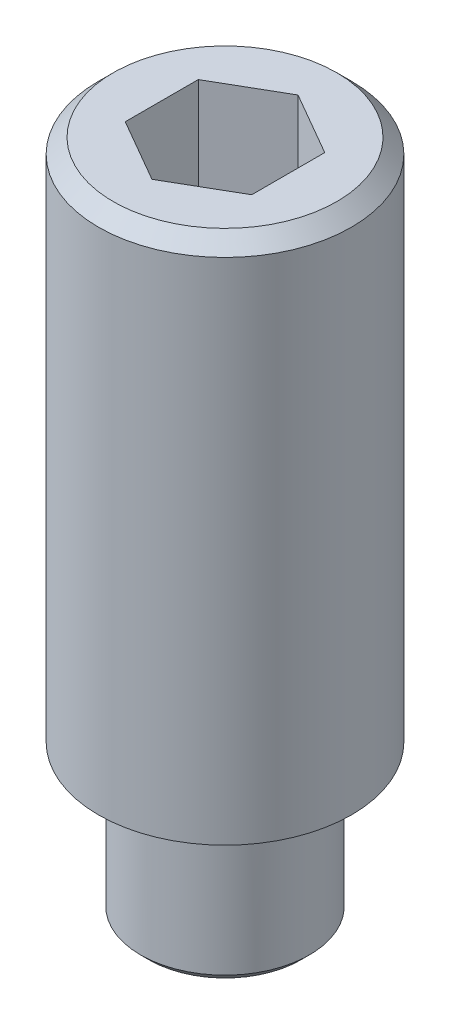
ISO-10303-21;
HEADER;
FILE_DESCRIPTION(('STEP AP214'),'2;1');
FILE_NAME('part.step','',(''),(''),'','','');
FILE_SCHEMA(('AUTOMOTIVE_DESIGN { 1 0 10303 214 1 1 1 1 }'));
ENDSEC;
DATA;
#1=APPLICATION_CONTEXT('core data for automotive mechanical design processes');
#2=APPLICATION_PROTOCOL_DEFINITION('international standard','automotive_design',2000,#1);
#3=PRODUCT_CONTEXT('',#1,'mechanical');
#4=PRODUCT('Part','Part','',(#3));
#5=PRODUCT_RELATED_PRODUCT_CATEGORY('part','',(#4));
#6=PRODUCT_DEFINITION_FORMATION('','',#4);
#7=PRODUCT_DEFINITION_CONTEXT('part definition',#1,'design');
#8=PRODUCT_DEFINITION('design','',#6,#7);
#9=PRODUCT_DEFINITION_SHAPE('','',#8);
#10=(LENGTH_UNIT() NAMED_UNIT(*) SI_UNIT(.MILLI.,.METRE.));
#11=(NAMED_UNIT(*) PLANE_ANGLE_UNIT() SI_UNIT($,.RADIAN.));
#12=(NAMED_UNIT(*) SI_UNIT($,.STERADIAN.) SOLID_ANGLE_UNIT());
#13=UNCERTAINTY_MEASURE_WITH_UNIT(LENGTH_MEASURE(1.E-05),#10,'distance_accuracy_value','');
#14=(GEOMETRIC_REPRESENTATION_CONTEXT(3) GLOBAL_UNCERTAINTY_ASSIGNED_CONTEXT((#13)) GLOBAL_UNIT_ASSIGNED_CONTEXT((#10,
#11,#12)) REPRESENTATION_CONTEXT('',''));
#15=CARTESIAN_POINT('',(0.,0.,0.));
#16=DIRECTION('',(0.,0.,1.));
#17=DIRECTION('',(1.,0.,0.));
#18=AXIS2_PLACEMENT_3D('',#15,#16,#17);
#19=CARTESIAN_POINT('',(0.,0.,0.));
#20=DIRECTION('',(0.,1.,0.));
#21=DIRECTION('',(0.,0.,1.));
#22=AXIS2_PLACEMENT_3D('',#19,#20,#21);
#23=PLANE('',#22);
#24=CARTESIAN_POINT('',(0.,0.,0.));
#25=DIRECTION('',(0.,1.,0.));
#26=DIRECTION('',(0.,0.,1.));
#27=AXIS2_PLACEMENT_3D('',#24,#25,#26);
#28=CIRCLE('',#27,1.8);
#29=CARTESIAN_POINT('',(0.,0.,1.8));
#30=VERTEX_POINT('',#29);
#31=EDGE_CURVE('E151',#30,#30,#28,.F.);
#32=ORIENTED_EDGE('',*,*,#31,.T.);
#33=EDGE_LOOP('',(#32));
#34=FACE_BOUND('',#33,.T.);
#35=ADVANCED_FACE('F38',(#34),#23,.F.);
#36=CARTESIAN_POINT('',(0.,0.,0.));
#37=DIRECTION('',(0.,-1.,0.));
#38=DIRECTION('',(0.,0.,-1.));
#39=AXIS2_PLACEMENT_3D('',#36,#37,#38);
#40=CYLINDRICAL_SURFACE('',#39,2.);
#41=CARTESIAN_POINT('',(0.,0.199999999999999,0.));
#42=DIRECTION('',(0.,1.,0.));
#43=DIRECTION('',(0.,0.,1.));
#44=AXIS2_PLACEMENT_3D('',#41,#42,#43);
#45=CIRCLE('',#44,2.);
#46=CARTESIAN_POINT('',(0.,0.2,2.));
#47=VERTEX_POINT('',#46);
#48=EDGE_CURVE('E154',#47,#47,#45,.T.);
#49=ORIENTED_EDGE('',*,*,#48,.T.);
#50=EDGE_LOOP('',(#49));
#51=FACE_BOUND('',#50,.T.);
#52=CARTESIAN_POINT('',(0.,3.,0.));
#53=DIRECTION('',(0.,-1.,0.));
#54=DIRECTION('',(0.,0.,-1.));
#55=AXIS2_PLACEMENT_3D('',#52,#53,#54);
#56=CIRCLE('',#55,2.);
#57=CARTESIAN_POINT('',(0.,3.,-2.));
#58=VERTEX_POINT('',#57);
#59=EDGE_CURVE('E148',#58,#58,#56,.T.);
#60=ORIENTED_EDGE('',*,*,#59,.T.);
#61=EDGE_LOOP('',(#60));
#62=FACE_BOUND('',#61,.T.);
#63=ADVANCED_FACE('F171',(#51,#62),#40,.T.);
#64=CARTESIAN_POINT('',(0.,3.57735026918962,0.));
#65=DIRECTION('',(0.,1.,0.));
#66=DIRECTION('',(0.,0.,1.));
#67=AXIS2_PLACEMENT_3D('',#64,#65,#66);
#68=CONICAL_SURFACE('',#67,3.,1.0471975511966);
#69=ORIENTED_EDGE('',*,*,#59,.F.);
#70=EDGE_LOOP('',(#69));
#71=FACE_BOUND('',#70,.T.);
#72=CARTESIAN_POINT('',(0.,3.57735026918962,0.));
#73=DIRECTION('',(0.,-1.,0.));
#74=DIRECTION('',(0.,0.,-1.));
#75=AXIS2_PLACEMENT_3D('',#72,#73,#74);
#76=CIRCLE('',#75,3.);
#77=CARTESIAN_POINT('',(0.,3.57735026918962,-3.));
#78=VERTEX_POINT('',#77);
#79=EDGE_CURVE('E140',#78,#78,#76,.T.);
#80=ORIENTED_EDGE('',*,*,#79,.T.);
#81=EDGE_LOOP('',(#80));
#82=FACE_BOUND('',#81,.T.);
#83=ADVANCED_FACE('F177',(#71,#82),#68,.T.);
#84=CARTESIAN_POINT('',(0.,0.,0.));
#85=DIRECTION('',(0.,-1.,0.));
#86=DIRECTION('',(0.,0.,-1.));
#87=AXIS2_PLACEMENT_3D('',#84,#85,#86);
#88=CYLINDRICAL_SURFACE('',#87,3.);
#89=CARTESIAN_POINT('',(0.,15.65,0.));
#90=DIRECTION('',(0.,-1.,0.));
#91=DIRECTION('',(0.,0.,-1.));
#92=AXIS2_PLACEMENT_3D('',#89,#90,#91);
#93=CIRCLE('',#92,3.);
#94=CARTESIAN_POINT('',(0.,15.65,-2.99999999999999));
#95=VERTEX_POINT('',#94);
#96=EDGE_CURVE('E46',#95,#95,#93,.T.);
#97=ORIENTED_EDGE('',*,*,#96,.T.);
#98=EDGE_LOOP('',(#97));
#99=FACE_BOUND('',#98,.T.);
#100=ORIENTED_EDGE('',*,*,#79,.F.);
#101=EDGE_LOOP('',(#100));
#102=FACE_BOUND('',#101,.T.);
#103=ADVANCED_FACE('F159',(#99,#102),#88,.T.);
#104=CARTESIAN_POINT('',(-3.00000000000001,16.,0.));
#105=DIRECTION('',(0.,-1.,0.));
#106=DIRECTION('',(0.,0.,-1.));
#107=AXIS2_PLACEMENT_3D('',#104,#105,#106);
#108=PLANE('',#107);
#109=CARTESIAN_POINT('',(0.,16.,0.));
#110=DIRECTION('',(0.,-1.,0.));
#111=DIRECTION('',(0.,0.,-1.));
#112=AXIS2_PLACEMENT_3D('',#109,#110,#111);
#113=CIRCLE('',#112,2.65);
#114=CARTESIAN_POINT('',(0.,16.,-2.64999999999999));
#115=VERTEX_POINT('',#114);
#116=EDGE_CURVE('E11',#115,#115,#113,.F.);
#117=ORIENTED_EDGE('',*,*,#116,.T.);
#118=EDGE_LOOP('',(#117));
#119=FACE_BOUND('',#118,.T.);
#120=DIRECTION('',(0.,0.,-1.));
#121=VECTOR('',#120,1.);
#122=CARTESIAN_POINT('',(1.5,16.,0.866025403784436));
#123=LINE('',#122,#121);
#124=CARTESIAN_POINT('',(1.5,16.,0.866025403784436));
#125=VERTEX_POINT('',#124);
#126=CARTESIAN_POINT('',(1.50000000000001,16.,-0.866025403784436));
#127=VERTEX_POINT('',#126);
#128=EDGE_CURVE('E127',#125,#127,#123,.T.);
#129=ORIENTED_EDGE('',*,*,#128,.F.);
#130=DIRECTION('',(0.866025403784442,0.,-0.500000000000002));
#131=VECTOR('',#130,1.);
#132=CARTESIAN_POINT('',(0.,16.,1.73205080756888));
#133=LINE('',#132,#131);
#134=CARTESIAN_POINT('',(0.,16.,1.73205080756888));
#135=VERTEX_POINT('',#134);
#136=EDGE_CURVE('E53',#135,#125,#133,.T.);
#137=ORIENTED_EDGE('',*,*,#136,.F.);
#138=DIRECTION('',(0.866025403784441,0.,0.499999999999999));
#139=VECTOR('',#138,1.);
#140=CARTESIAN_POINT('',(-1.5,16.,0.866025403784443));
#141=LINE('',#140,#139);
#142=CARTESIAN_POINT('',(-1.5,16.,0.866025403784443));
#143=VERTEX_POINT('',#142);
#144=EDGE_CURVE('E136',#143,#135,#141,.T.);
#145=ORIENTED_EDGE('',*,*,#144,.F.);
#146=DIRECTION('',(0.,0.,1.));
#147=VECTOR('',#146,1.);
#148=CARTESIAN_POINT('',(-1.5,16.,-0.866025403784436));
#149=LINE('',#148,#147);
#150=CARTESIAN_POINT('',(-1.5,16.,-0.866025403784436));
#151=VERTEX_POINT('',#150);
#152=EDGE_CURVE('E134',#151,#143,#149,.T.);
#153=ORIENTED_EDGE('',*,*,#152,.F.);
#154=DIRECTION('',(-0.866025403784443,0.,0.500000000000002));
#155=VECTOR('',#154,1.);
#156=CARTESIAN_POINT('',(0.,16.,-1.73205080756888));
#157=LINE('',#156,#155);
#158=CARTESIAN_POINT('',(0.,16.,-1.73205080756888));
#159=VERTEX_POINT('',#158);
#160=EDGE_CURVE('E101',#159,#151,#157,.T.);
#161=ORIENTED_EDGE('',*,*,#160,.F.);
#162=DIRECTION('',(-0.866025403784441,0.,-0.499999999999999));
#163=VECTOR('',#162,1.);
#164=CARTESIAN_POINT('',(1.50000000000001,16.,-0.866025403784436));
#165=LINE('',#164,#163);
#166=EDGE_CURVE('E130',#127,#159,#165,.T.);
#167=ORIENTED_EDGE('',*,*,#166,.F.);
#168=EDGE_LOOP('',(#129,#137,#145,#153,#161,#167));
#169=FACE_BOUND('',#168,.T.);
#170=ADVANCED_FACE('F186',(#119,#169),#108,.F.);
#171=CARTESIAN_POINT('',(0.,13.5,1.73205080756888));
#172=DIRECTION('',(0.500000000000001,0.,0.866025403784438));
#173=DIRECTION('',(0.866025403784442,0.,-0.500000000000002));
#174=AXIS2_PLACEMENT_3D('',#171,#172,#173);
#175=PLANE('',#174);
#176=ORIENTED_EDGE('',*,*,#136,.T.);
#177=DIRECTION('',(0.,1.,0.));
#178=VECTOR('',#177,1.);
#179=CARTESIAN_POINT('',(1.5,13.5,0.866025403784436));
#180=LINE('',#179,#178);
#181=CARTESIAN_POINT('',(1.5,13.5,0.866025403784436));
#182=VERTEX_POINT('',#181);
#183=EDGE_CURVE('E83',#182,#125,#180,.T.);
#184=ORIENTED_EDGE('',*,*,#183,.F.);
#185=DIRECTION('',(0.866025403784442,0.,-0.500000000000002));
#186=VECTOR('',#185,1.);
#187=CARTESIAN_POINT('',(0.,13.5,1.73205080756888));
#188=LINE('',#187,#186);
#189=CARTESIAN_POINT('',(0.,13.5,1.73205080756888));
#190=VERTEX_POINT('',#189);
#191=EDGE_CURVE('E138',#190,#182,#188,.T.);
#192=ORIENTED_EDGE('',*,*,#191,.F.);
#193=DIRECTION('',(0.,1.,0.));
#194=VECTOR('',#193,1.);
#195=CARTESIAN_POINT('',(0.,13.5,1.73205080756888));
#196=LINE('',#195,#194);
#197=EDGE_CURVE('E61',#190,#135,#196,.T.);
#198=ORIENTED_EDGE('',*,*,#197,.T.);
#199=EDGE_LOOP('',(#176,#184,#192,#198));
#200=FACE_BOUND('',#199,.T.);
#201=ADVANCED_FACE('F189',(#200),#175,.F.);
#202=CARTESIAN_POINT('',(-1.5,13.5,0.866025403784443));
#203=DIRECTION('',(-0.500000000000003,0.,0.86602540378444));
#204=DIRECTION('',(0.866025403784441,0.,0.499999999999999));
#205=AXIS2_PLACEMENT_3D('',#202,#203,#204);
#206=PLANE('',#205);
#207=ORIENTED_EDGE('',*,*,#144,.T.);
#208=ORIENTED_EDGE('',*,*,#197,.F.);
#209=DIRECTION('',(0.866025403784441,0.,0.499999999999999));
#210=VECTOR('',#209,1.);
#211=CARTESIAN_POINT('',(-1.5,13.5,0.866025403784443));
#212=LINE('',#211,#210);
#213=CARTESIAN_POINT('',(-1.5,13.5,0.866025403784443));
#214=VERTEX_POINT('',#213);
#215=EDGE_CURVE('E113',#214,#190,#212,.T.);
#216=ORIENTED_EDGE('',*,*,#215,.F.);
#217=DIRECTION('',(0.,1.,0.));
#218=VECTOR('',#217,1.);
#219=CARTESIAN_POINT('',(-1.5,13.5,0.866025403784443));
#220=LINE('',#219,#218);
#221=EDGE_CURVE('E105',#214,#143,#220,.T.);
#222=ORIENTED_EDGE('',*,*,#221,.T.);
#223=EDGE_LOOP('',(#207,#208,#216,#222));
#224=FACE_BOUND('',#223,.T.);
#225=ADVANCED_FACE('F193',(#224),#206,.F.);
#226=CARTESIAN_POINT('',(-1.5,13.5,-0.866025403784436));
#227=DIRECTION('',(-1.,0.,0.));
#228=DIRECTION('',(0.,0.,1.));
#229=AXIS2_PLACEMENT_3D('',#226,#227,#228);
#230=PLANE('',#229);
#231=ORIENTED_EDGE('',*,*,#152,.T.);
#232=ORIENTED_EDGE('',*,*,#221,.F.);
#233=DIRECTION('',(0.,0.,1.));
#234=VECTOR('',#233,1.);
#235=CARTESIAN_POINT('',(-1.5,13.5,-0.866025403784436));
#236=LINE('',#235,#234);
#237=CARTESIAN_POINT('',(-1.5,13.5,-0.866025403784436));
#238=VERTEX_POINT('',#237);
#239=EDGE_CURVE('E109',#238,#214,#236,.T.);
#240=ORIENTED_EDGE('',*,*,#239,.F.);
#241=DIRECTION('',(0.,1.,0.));
#242=VECTOR('',#241,1.);
#243=CARTESIAN_POINT('',(-1.5,13.5,-0.866025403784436));
#244=LINE('',#243,#242);
#245=EDGE_CURVE('E94',#238,#151,#244,.T.);
#246=ORIENTED_EDGE('',*,*,#245,.T.);
#247=EDGE_LOOP('',(#231,#232,#240,#246));
#248=FACE_BOUND('',#247,.T.);
#249=ADVANCED_FACE('F110',(#248),#230,.F.);
#250=CARTESIAN_POINT('',(0.,13.5,-1.73205080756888));
#251=DIRECTION('',(-0.5,0.,-0.866025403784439));
#252=DIRECTION('',(-0.866025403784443,0.,0.500000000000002));
#253=AXIS2_PLACEMENT_3D('',#250,#251,#252);
#254=PLANE('',#253);
#255=ORIENTED_EDGE('',*,*,#160,.T.);
#256=ORIENTED_EDGE('',*,*,#245,.F.);
#257=DIRECTION('',(-0.866025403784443,0.,0.500000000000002));
#258=VECTOR('',#257,1.);
#259=CARTESIAN_POINT('',(0.,13.5,-1.73205080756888));
#260=LINE('',#259,#258);
#261=CARTESIAN_POINT('',(0.,13.5,-1.73205080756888));
#262=VERTEX_POINT('',#261);
#263=EDGE_CURVE('E98',#262,#238,#260,.T.);
#264=ORIENTED_EDGE('',*,*,#263,.F.);
#265=DIRECTION('',(0.,1.,0.));
#266=VECTOR('',#265,1.);
#267=CARTESIAN_POINT('',(0.,13.5,-1.73205080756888));
#268=LINE('',#267,#266);
#269=EDGE_CURVE('E106',#262,#159,#268,.T.);
#270=ORIENTED_EDGE('',*,*,#269,.T.);
#271=EDGE_LOOP('',(#255,#256,#264,#270));
#272=FACE_BOUND('',#271,.T.);
#273=ADVANCED_FACE('F96',(#272),#254,.F.);
#274=CARTESIAN_POINT('',(1.50000000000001,13.5,-0.866025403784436));
#275=DIRECTION('',(0.500000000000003,0.,-0.86602540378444));
#276=DIRECTION('',(-0.866025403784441,0.,-0.499999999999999));
#277=AXIS2_PLACEMENT_3D('',#274,#275,#276);
#278=PLANE('',#277);
#279=ORIENTED_EDGE('',*,*,#166,.T.);
#280=ORIENTED_EDGE('',*,*,#269,.F.);
#281=DIRECTION('',(-0.866025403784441,0.,-0.499999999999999));
#282=VECTOR('',#281,1.);
#283=CARTESIAN_POINT('',(1.50000000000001,13.5,-0.866025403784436));
#284=LINE('',#283,#282);
#285=CARTESIAN_POINT('',(1.50000000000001,13.5,-0.866025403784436));
#286=VERTEX_POINT('',#285);
#287=EDGE_CURVE('E119',#286,#262,#284,.T.);
#288=ORIENTED_EDGE('',*,*,#287,.F.);
#289=DIRECTION('',(0.,1.,0.));
#290=VECTOR('',#289,1.);
#291=CARTESIAN_POINT('',(1.50000000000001,13.5,-0.866025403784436));
#292=LINE('',#291,#290);
#293=EDGE_CURVE('E143',#286,#127,#292,.T.);
#294=ORIENTED_EDGE('',*,*,#293,.T.);
#295=EDGE_LOOP('',(#279,#280,#288,#294));
#296=FACE_BOUND('',#295,.T.);
#297=ADVANCED_FACE('F197',(#296),#278,.F.);
#298=CARTESIAN_POINT('',(1.5,13.5,0.866025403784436));
#299=DIRECTION('',(1.,0.,0.));
#300=DIRECTION('',(0.,0.,-1.));
#301=AXIS2_PLACEMENT_3D('',#298,#299,#300);
#302=PLANE('',#301);
#303=ORIENTED_EDGE('',*,*,#128,.T.);
#304=ORIENTED_EDGE('',*,*,#293,.F.);
#305=DIRECTION('',(0.,0.,-1.));
#306=VECTOR('',#305,1.);
#307=CARTESIAN_POINT('',(1.5,13.5,0.866025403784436));
#308=LINE('',#307,#306);
#309=EDGE_CURVE('E121',#182,#286,#308,.T.);
#310=ORIENTED_EDGE('',*,*,#309,.F.);
#311=ORIENTED_EDGE('',*,*,#183,.T.);
#312=EDGE_LOOP('',(#303,#304,#310,#311));
#313=FACE_BOUND('',#312,.T.);
#314=ADVANCED_FACE('F194',(#313),#302,.F.);
#315=CARTESIAN_POINT('',(0.,13.5,0.));
#316=DIRECTION('',(0.,1.,0.));
#317=DIRECTION('',(0.,0.,1.));
#318=AXIS2_PLACEMENT_3D('',#315,#316,#317);
#319=PLANE('',#318);
#320=ORIENTED_EDGE('',*,*,#191,.T.);
#321=ORIENTED_EDGE('',*,*,#309,.T.);
#322=ORIENTED_EDGE('',*,*,#287,.T.);
#323=ORIENTED_EDGE('',*,*,#263,.T.);
#324=ORIENTED_EDGE('',*,*,#239,.T.);
#325=ORIENTED_EDGE('',*,*,#215,.T.);
#326=EDGE_LOOP('',(#320,#321,#322,#323,#324,#325));
#327=FACE_BOUND('',#326,.T.);
#328=ADVANCED_FACE('F116',(#327),#319,.T.);
#329=CARTESIAN_POINT('',(0.,0.,0.));
#330=DIRECTION('',(0.,1.,0.));
#331=DIRECTION('',(0.,0.,1.));
#332=AXIS2_PLACEMENT_3D('',#329,#330,#331);
#333=CONICAL_SURFACE('',#332,1.8,0.785398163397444);
#334=ORIENTED_EDGE('',*,*,#48,.F.);
#335=EDGE_LOOP('',(#334));
#336=FACE_BOUND('',#335,.T.);
#337=ORIENTED_EDGE('',*,*,#31,.F.);
#338=EDGE_LOOP('',(#337));
#339=FACE_BOUND('',#338,.T.);
#340=ADVANCED_FACE('F163',(#336,#339),#333,.T.);
#341=CARTESIAN_POINT('',(0.,15.65,0.));
#342=DIRECTION('',(0.,-1.,0.));
#343=DIRECTION('',(0.,0.,-1.));
#344=AXIS2_PLACEMENT_3D('',#341,#342,#343);
#345=CONICAL_SURFACE('',#344,3.,0.785398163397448);
#346=ORIENTED_EDGE('',*,*,#116,.F.);
#347=EDGE_LOOP('',(#346));
#348=FACE_BOUND('',#347,.T.);
#349=ORIENTED_EDGE('',*,*,#96,.F.);
#350=EDGE_LOOP('',(#349));
#351=FACE_BOUND('',#350,.T.);
#352=ADVANCED_FACE('F40',(#348,#351),#345,.T.);
#353=CLOSED_SHELL('',(#35,#63,#83,#103,#170,#201,#225,#249,#273,#297,#314,#328,#340,#352));
#354=MANIFOLD_SOLID_BREP('B2',#353);
#355=ADVANCED_BREP_SHAPE_REPRESENTATION('',(#18,#354),#14);
#356=SHAPE_DEFINITION_REPRESENTATION(#9,#355);
ENDSEC;
END-ISO-10303-21;
